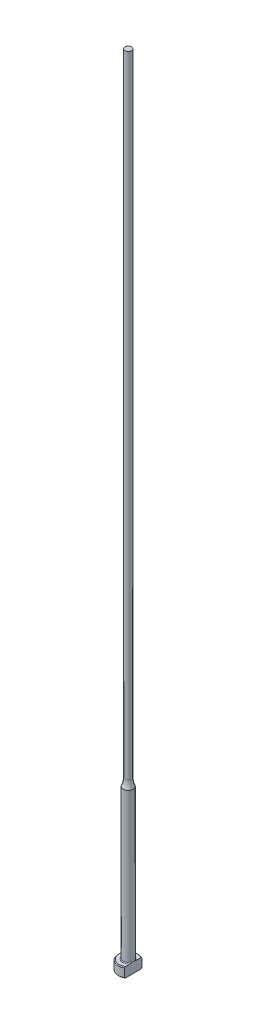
ISO-10303-21;
HEADER;
FILE_DESCRIPTION(('STEP AP214'),'2;1');
FILE_NAME('part.step','',(''),(''),'','','');
FILE_SCHEMA(('AUTOMOTIVE_DESIGN { 1 0 10303 214 1 1 1 1 }'));
ENDSEC;
DATA;
#1=APPLICATION_CONTEXT('core data for automotive mechanical design processes');
#2=APPLICATION_PROTOCOL_DEFINITION('international standard','automotive_design',2000,#1);
#3=PRODUCT_CONTEXT('',#1,'mechanical');
#4=PRODUCT('Part','Part','',(#3));
#5=PRODUCT_RELATED_PRODUCT_CATEGORY('part','',(#4));
#6=PRODUCT_DEFINITION_FORMATION('','',#4);
#7=PRODUCT_DEFINITION_CONTEXT('part definition',#1,'design');
#8=PRODUCT_DEFINITION('design','',#6,#7);
#9=PRODUCT_DEFINITION_SHAPE('','',#8);
#10=(LENGTH_UNIT() NAMED_UNIT(*) SI_UNIT(.MILLI.,.METRE.));
#11=(NAMED_UNIT(*) PLANE_ANGLE_UNIT() SI_UNIT($,.RADIAN.));
#12=(NAMED_UNIT(*) SI_UNIT($,.STERADIAN.) SOLID_ANGLE_UNIT());
#13=UNCERTAINTY_MEASURE_WITH_UNIT(LENGTH_MEASURE(1.E-05),#10,'distance_accuracy_value','');
#14=(GEOMETRIC_REPRESENTATION_CONTEXT(3) GLOBAL_UNCERTAINTY_ASSIGNED_CONTEXT((#13)) GLOBAL_UNIT_ASSIGNED_CONTEXT((#10,
#11,#12)) REPRESENTATION_CONTEXT('',''));
#15=CARTESIAN_POINT('',(0.,0.,0.));
#16=DIRECTION('',(0.,0.,1.));
#17=DIRECTION('',(1.,0.,0.));
#18=AXIS2_PLACEMENT_3D('',#15,#16,#17);
#19=CARTESIAN_POINT('',(-3.17499999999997,3.175,0.));
#20=DIRECTION('',(0.,1.,0.));
#21=DIRECTION('',(0.,0.,1.));
#22=AXIS2_PLACEMENT_3D('',#19,#20,#21);
#23=PLANE('',#22);
#24=CARTESIAN_POINT('',(0.,3.175,0.));
#25=DIRECTION('',(0.,1.,0.));
#26=DIRECTION('',(0.,0.,1.));
#27=AXIS2_PLACEMENT_3D('',#24,#25,#26);
#28=CIRCLE('',#27,2.92099999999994);
#29=CARTESIAN_POINT('',(1.58749999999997,3.175,-2.45195529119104));
#30=VERTEX_POINT('',#29);
#31=CARTESIAN_POINT('',(1.58749999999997,3.175,2.45195529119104));
#32=VERTEX_POINT('',#31);
#33=EDGE_CURVE('E105',#30,#32,#28,.T.);
#34=ORIENTED_EDGE('',*,*,#33,.T.);
#35=DIRECTION('',(0.,0.,1.));
#36=VECTOR('',#35,1.);
#37=CARTESIAN_POINT('',(1.58749999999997,3.17499999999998,2.74963065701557));
#38=LINE('',#37,#36);
#39=CARTESIAN_POINT('',(1.58749999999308,3.175,0.933255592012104));
#40=VERTEX_POINT('',#39);
#41=EDGE_CURVE('E126',#40,#32,#38,.T.);
#42=ORIENTED_EDGE('',*,*,#41,.F.);
#43=CARTESIAN_POINT('',(0.,3.175,0.));
#44=DIRECTION('',(0.,1.,0.));
#45=DIRECTION('',(0.,0.,1.));
#46=AXIS2_PLACEMENT_3D('',#43,#44,#45);
#47=CIRCLE('',#46,1.84149999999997);
#48=CARTESIAN_POINT('',(1.58749999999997,3.17500000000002,-0.933255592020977));
#49=VERTEX_POINT('',#48);
#50=EDGE_CURVE('E11',#40,#49,#47,.F.);
#51=ORIENTED_EDGE('',*,*,#50,.T.);
#52=EDGE_CURVE('E52',#30,#49,#38,.T.);
#53=ORIENTED_EDGE('',*,*,#52,.F.);
#54=EDGE_LOOP('',(#34,#42,#51,#53));
#55=FACE_BOUND('',#54,.T.);
#56=ADVANCED_FACE('F32',(#55),#23,.T.);
#57=CARTESIAN_POINT('',(0.,259.958771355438,0.));
#58=DIRECTION('',(0.,1.,0.));
#59=DIRECTION('',(0.,0.,1.));
#60=AXIS2_PLACEMENT_3D('',#57,#58,#59);
#61=CYLINDRICAL_SURFACE('',#60,3.17499999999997);
#62=CARTESIAN_POINT('',(0.,2.92100000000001,0.));
#63=DIRECTION('',(0.,1.,0.));
#64=DIRECTION('',(0.,0.,1.));
#65=AXIS2_PLACEMENT_3D('',#62,#63,#64);
#66=CIRCLE('',#65,3.17499999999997);
#67=CARTESIAN_POINT('',(1.58749999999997,2.92100000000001,2.74963065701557));
#68=VERTEX_POINT('',#67);
#69=CARTESIAN_POINT('',(1.58749999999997,2.92100000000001,-2.74963065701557));
#70=VERTEX_POINT('',#69);
#71=EDGE_CURVE('E98',#68,#70,#66,.F.);
#72=ORIENTED_EDGE('',*,*,#71,.T.);
#73=DIRECTION('',(0.,-1.,0.));
#74=VECTOR('',#73,1.);
#75=CARTESIAN_POINT('',(1.58749999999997,254.001,-2.74963065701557));
#76=LINE('',#75,#74);
#77=CARTESIAN_POINT('',(1.58749999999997,0.253999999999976,-2.74963065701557));
#78=VERTEX_POINT('',#77);
#79=EDGE_CURVE('E141',#70,#78,#76,.T.);
#80=ORIENTED_EDGE('',*,*,#79,.T.);
#81=CARTESIAN_POINT('',(0.,0.253999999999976,0.));
#82=DIRECTION('',(0.,-1.,0.));
#83=DIRECTION('',(0.,0.,-1.));
#84=AXIS2_PLACEMENT_3D('',#81,#82,#83);
#85=CIRCLE('',#84,3.17499999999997);
#86=CARTESIAN_POINT('',(1.58749999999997,0.253999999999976,2.74963065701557));
#87=VERTEX_POINT('',#86);
#88=EDGE_CURVE('E95',#78,#87,#85,.F.);
#89=ORIENTED_EDGE('',*,*,#88,.T.);
#90=DIRECTION('',(0.,-1.,0.));
#91=VECTOR('',#90,1.);
#92=CARTESIAN_POINT('',(1.58749999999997,254.001,2.74963065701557));
#93=LINE('',#92,#91);
#94=EDGE_CURVE('E88',#68,#87,#93,.T.);
#95=ORIENTED_EDGE('',*,*,#94,.F.);
#96=EDGE_LOOP('',(#72,#80,#89,#95));
#97=FACE_BOUND('',#96,.T.);
#98=ADVANCED_FACE('F191',(#97),#61,.T.);
#99=CARTESIAN_POINT('',(0.,0.,0.));
#100=DIRECTION('',(0.,-1.,0.));
#101=DIRECTION('',(0.,0.,-1.));
#102=AXIS2_PLACEMENT_3D('',#99,#100,#101);
#103=PLANE('',#102);
#104=CARTESIAN_POINT('',(0.,0.,0.));
#105=DIRECTION('',(0.,-1.,0.));
#106=DIRECTION('',(0.,0.,-1.));
#107=AXIS2_PLACEMENT_3D('',#104,#105,#106);
#108=CIRCLE('',#107,2.92100000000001);
#109=CARTESIAN_POINT('',(1.58749999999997,0.,2.45195529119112));
#110=VERTEX_POINT('',#109);
#111=CARTESIAN_POINT('',(1.58749999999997,0.,-2.45195529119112));
#112=VERTEX_POINT('',#111);
#113=EDGE_CURVE('E93',#110,#112,#108,.T.);
#114=ORIENTED_EDGE('',*,*,#113,.T.);
#115=DIRECTION('',(0.,0.,1.));
#116=VECTOR('',#115,1.);
#117=CARTESIAN_POINT('',(1.58749999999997,0.,2.74963065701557));
#118=LINE('',#117,#116);
#119=EDGE_CURVE('E78',#112,#110,#118,.T.);
#120=ORIENTED_EDGE('',*,*,#119,.T.);
#121=EDGE_LOOP('',(#114,#120));
#122=FACE_BOUND('',#121,.T.);
#123=ADVANCED_FACE('F97',(#122),#103,.T.);
#124=CARTESIAN_POINT('',(0.,3.17499999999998,0.));
#125=DIRECTION('',(0.,-1.,0.));
#126=DIRECTION('',(0.,0.,-1.));
#127=AXIS2_PLACEMENT_3D('',#124,#125,#126);
#128=CONICAL_SURFACE('',#127,2.92099999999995,0.785398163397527);
#129=ORIENTED_EDGE('',*,*,#71,.F.);
#130=CARTESIAN_POINT('',(1.58749999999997,-0.16162066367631,-6.0529050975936));
#131=CARTESIAN_POINT('',(1.58749999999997,-0.0288893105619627,-5.91567682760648));
#132=CARTESIAN_POINT('',(1.58749999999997,0.103699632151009,-5.7783103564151));
#133=CARTESIAN_POINT('',(1.58749999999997,0.368508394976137,-5.50321874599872));
#134=CARTESIAN_POINT('',(1.58749999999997,0.500728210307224,-5.36549360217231));
#135=CARTESIAN_POINT('',(1.58749999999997,0.764778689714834,-5.08953516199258));
#136=CARTESIAN_POINT('',(1.58749999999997,0.896609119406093,-4.9513016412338));
#137=CARTESIAN_POINT('',(1.58749999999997,1.15968706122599,-4.67428233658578));
#138=CARTESIAN_POINT('',(1.58749999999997,1.29093457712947,-4.53549655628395));
#139=CARTESIAN_POINT('',(1.58749999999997,1.55007705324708,-4.25997724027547));
#140=CARTESIAN_POINT('',(1.58749999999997,1.67798684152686,-4.12325766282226));
#141=CARTESIAN_POINT('',(1.58749999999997,1.9328486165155,-3.84892898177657));
#142=CARTESIAN_POINT('',(1.58749999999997,2.05980060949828,-3.71131988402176));
#143=CARTESIAN_POINT('',(1.58749999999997,2.31237508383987,-3.43493978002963));
#144=CARTESIAN_POINT('',(1.58749999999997,2.43799784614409,-3.29616903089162));
#145=CARTESIAN_POINT('',(1.58749999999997,2.68741369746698,-3.01699558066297));
#146=CARTESIAN_POINT('',(1.58749999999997,2.81120686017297,-2.8765929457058));
#147=CARTESIAN_POINT('',(1.58749999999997,3.00875865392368,-2.64816703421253));
#148=CARTESIAN_POINT('',(1.58749999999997,3.08336151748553,-2.56087478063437));
#149=CARTESIAN_POINT('',(1.58749999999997,3.2312387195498,-2.38515423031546));
#150=CARTESIAN_POINT('',(1.58749999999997,3.30451292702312,-2.29672582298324));
#151=CARTESIAN_POINT('',(1.58749999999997,3.45004422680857,-2.1174740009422));
#152=CARTESIAN_POINT('',(1.58749999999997,3.5222823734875,-2.02663514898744));
#153=CARTESIAN_POINT('',(1.58749999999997,3.66423097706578,-1.8430252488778));
#154=CARTESIAN_POINT('',(1.58749999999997,3.73394203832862,-1.75025467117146));
#155=CARTESIAN_POINT('',(1.58749999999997,3.87080633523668,-1.5606747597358));
#156=CARTESIAN_POINT('',(1.58749999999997,3.93790459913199,-1.46382547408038));
#157=CARTESIAN_POINT('',(1.58749999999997,4.06669147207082,-1.26632594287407));
#158=CARTESIAN_POINT('',(1.58749999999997,4.1283726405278,-1.16567073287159));
#159=CARTESIAN_POINT('',(1.58749999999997,4.21402252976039,-1.01165766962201));
#160=CARTESIAN_POINT('',(1.58749999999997,4.24127929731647,-0.960142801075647));
#161=CARTESIAN_POINT('',(1.58749999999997,4.2930979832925,-0.855780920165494));
#162=CARTESIAN_POINT('',(1.58749999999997,4.31765941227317,-0.802933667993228));
#163=CARTESIAN_POINT('',(1.58749999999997,4.38614656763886,-0.642461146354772));
#164=CARTESIAN_POINT('',(1.58749999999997,4.42510149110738,-0.532518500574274));
#165=CARTESIAN_POINT('',(1.58749999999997,4.46726244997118,-0.367680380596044));
#166=CARTESIAN_POINT('',(1.58749999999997,4.47844427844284,-0.314802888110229));
#167=CARTESIAN_POINT('',(1.58749999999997,4.49576654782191,-0.208209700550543));
#168=CARTESIAN_POINT('',(1.58749999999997,4.50190743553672,-0.154494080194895));
#169=CARTESIAN_POINT('',(1.58749999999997,4.50871296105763,-0.0468792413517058));
#170=CARTESIAN_POINT('',(1.58749999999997,4.5093945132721,0.00701889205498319));
#171=CARTESIAN_POINT('',(1.58749999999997,4.50527679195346,0.114606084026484));
#172=CARTESIAN_POINT('',(1.58749999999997,4.50047706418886,0.168295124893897));
#173=CARTESIAN_POINT('',(1.58749999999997,4.48579689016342,0.27448544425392));
#174=CARTESIAN_POINT('',(1.58749999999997,4.47596081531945,0.32699298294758));
#175=CARTESIAN_POINT('',(1.58749999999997,4.45181809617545,0.430974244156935));
#176=CARTESIAN_POINT('',(1.58749999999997,4.4375096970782,0.482447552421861));
#177=CARTESIAN_POINT('',(1.58749999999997,4.40502489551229,0.584460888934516));
#178=CARTESIAN_POINT('',(1.58749999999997,4.386827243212,0.634994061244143));
#179=CARTESIAN_POINT('',(1.58749999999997,4.34729308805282,0.734789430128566));
#180=CARTESIAN_POINT('',(1.58749999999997,4.3259572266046,0.784051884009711));
#181=CARTESIAN_POINT('',(1.58749999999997,4.25791922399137,0.930549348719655));
#182=CARTESIAN_POINT('',(1.58749999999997,4.20736047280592,1.0259880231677));
#183=CARTESIAN_POINT('',(1.58749999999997,4.0995545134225,1.21304313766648));
#184=CARTESIAN_POINT('',(1.58749999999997,4.04229912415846,1.30465471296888));
#185=CARTESIAN_POINT('',(1.58749999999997,3.92308746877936,1.48526211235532));
#186=CARTESIAN_POINT('',(1.58749999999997,3.86111349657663,1.57424615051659));
#187=CARTESIAN_POINT('',(1.58749999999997,3.73408621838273,1.74990003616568));
#188=CARTESIAN_POINT('',(1.58749999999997,3.66903444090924,1.83657099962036));
#189=CARTESIAN_POINT('',(1.58749999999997,3.53583371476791,2.00931764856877));
#190=CARTESIAN_POINT('',(1.58749999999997,3.46765527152,2.09537048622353));
#191=CARTESIAN_POINT('',(1.58749999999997,3.32960643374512,2.26611736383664));
#192=CARTESIAN_POINT('',(1.58749999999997,3.25973586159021,2.35081125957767));
#193=CARTESIAN_POINT('',(1.58749999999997,3.04858139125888,2.60290121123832));
#194=CARTESIAN_POINT('',(1.58749999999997,2.90542388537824,2.76872537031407));
#195=CARTESIAN_POINT('',(1.58749999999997,2.64069522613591,3.06970913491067));
#196=CARTESIAN_POINT('',(1.58749999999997,2.51959458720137,3.20528660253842));
#197=CARTESIAN_POINT('',(1.58749999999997,2.27590400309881,3.47510321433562));
#198=CARTESIAN_POINT('',(1.58749999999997,2.15331401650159,3.60934232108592));
#199=CARTESIAN_POINT('',(1.58749999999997,1.90694239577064,3.87695374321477));
#200=CARTESIAN_POINT('',(1.58749999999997,1.78315974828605,4.0103251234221));
#201=CARTESIAN_POINT('',(1.58749999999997,1.53478104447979,4.27630880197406));
#202=CARTESIAN_POINT('',(1.58749999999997,1.41018498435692,4.40892109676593));
#203=CARTESIAN_POINT('',(1.58749999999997,1.0457468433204,4.79499418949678));
#204=CARTESIAN_POINT('',(1.58749999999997,0.80507680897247,5.04767313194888));
#205=CARTESIAN_POINT('',(1.58749999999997,0.443121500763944,5.42550911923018));
#206=CARTESIAN_POINT('',(1.58749999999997,0.322378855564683,5.55118772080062));
#207=CARTESIAN_POINT('',(1.58749999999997,0.0805914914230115,5.80225207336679));
#208=CARTESIAN_POINT('',(1.58749999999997,-0.040453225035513,5.92763782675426));
#209=CARTESIAN_POINT('',(1.58749999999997,-0.161620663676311,6.0529050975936));
#210=B_SPLINE_CURVE_WITH_KNOTS('',3,(#130,#131,#132,#133,#134,#135,#136,#137,#138,#139,#140,
#141,#142,#143,#144,#145,#146,#147,#148,#149,#150,#151,#152,#153,#154,#155,#156,#157,#158,#159,
#160,#161,#162,#163,#164,#165,#166,#167,#168,#169,#170,#171,#172,#173,#174,#175,#176,#177,#178,
#179,#180,#181,#182,#183,#184,#185,#186,#187,#188,#189,#190,#191,#192,#193,#194,#195,#196,#197,
#198,#199,#200,#201,#202,#203,#204,#205,#206,#207,#208,#209),.UNSPECIFIED.,.F.,.F.,(4,2,2,2,2,2,
2,2,2,2,2,2,2,2,2,2,2,2,2,2,2,2,2,2,2,2,2,2,2,2,2,2,2,2,2,2,2,2,2,4),(0.,0.572750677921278,
1.14550874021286,1.71856057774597,2.29160869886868,2.85328006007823,3.4149477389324,
3.97649423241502,4.53801804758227,4.88249307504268,5.22700189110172,5.5751532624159,
5.92322081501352,6.27657800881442,6.63041319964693,6.80518126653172,6.9799810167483,
7.3282426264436,7.49018491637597,7.65211285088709,7.81353889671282,7.97497832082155,
8.13501929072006,8.29512313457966,8.45612518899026,8.61709438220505,8.94062993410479,
9.2645649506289,9.58978187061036,9.91483894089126,10.2441741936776,10.5735441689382,
11.2306812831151,11.7760337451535,12.3214014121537,12.8672825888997,13.4131663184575,
14.4600164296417,14.9828595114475,15.5056983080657),.UNSPECIFIED.);
#211=EDGE_CURVE('E118',#32,#68,#210,.T.);
#212=ORIENTED_EDGE('',*,*,#211,.F.);
#213=ORIENTED_EDGE('',*,*,#33,.F.);
#214=EDGE_CURVE('E117',#70,#30,#210,.T.);
#215=ORIENTED_EDGE('',*,*,#214,.F.);
#216=EDGE_LOOP('',(#129,#212,#213,#215));
#217=FACE_BOUND('',#216,.T.);
#218=ADVANCED_FACE('F162',(#217),#128,.T.);
#219=CARTESIAN_POINT('',(0.,0.253999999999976,0.));
#220=DIRECTION('',(0.,1.,0.));
#221=DIRECTION('',(0.,0.,1.));
#222=AXIS2_PLACEMENT_3D('',#219,#220,#221);
#223=CONICAL_SURFACE('',#222,3.17499999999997,0.785398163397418);
#224=ORIENTED_EDGE('',*,*,#88,.F.);
#225=CARTESIAN_POINT('',(1.58749999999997,3.33662066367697,6.0529050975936));
#226=CARTESIAN_POINT('',(1.58749999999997,3.20388931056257,5.91567682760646));
#227=CARTESIAN_POINT('',(1.58749999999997,3.07130036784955,5.77831035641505));
#228=CARTESIAN_POINT('',(1.58749999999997,2.80649160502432,5.50321874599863));
#229=CARTESIAN_POINT('',(1.58749999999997,2.67427178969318,5.3654936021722));
#230=CARTESIAN_POINT('',(1.58749999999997,2.41022131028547,5.08953516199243));
#231=CARTESIAN_POINT('',(1.58749999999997,2.27839088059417,4.95130164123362));
#232=CARTESIAN_POINT('',(1.58749999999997,2.01531293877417,4.67428233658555));
#233=CARTESIAN_POINT('',(1.58749999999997,1.88406542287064,4.5354965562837));
#234=CARTESIAN_POINT('',(1.58749999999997,1.62492294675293,4.25997724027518));
#235=CARTESIAN_POINT('',(1.58749999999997,1.49701315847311,4.12325766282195));
#236=CARTESIAN_POINT('',(1.58749999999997,1.24215138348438,3.84892898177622));
#237=CARTESIAN_POINT('',(1.58749999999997,1.11519939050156,3.71131988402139));
#238=CARTESIAN_POINT('',(1.58749999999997,0.862624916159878,3.43493978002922));
#239=CARTESIAN_POINT('',(1.58749999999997,0.737002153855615,3.29616903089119));
#240=CARTESIAN_POINT('',(1.58749999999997,0.487586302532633,3.01699558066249));
#241=CARTESIAN_POINT('',(1.58749999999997,0.363793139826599,2.8765929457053));
#242=CARTESIAN_POINT('',(1.58749999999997,0.166241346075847,2.64816703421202));
#243=CARTESIAN_POINT('',(1.58749999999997,0.0916384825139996,2.56087478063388));
#244=CARTESIAN_POINT('',(1.58749999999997,-0.0562387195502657,2.385154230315));
#245=CARTESIAN_POINT('',(1.58749999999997,-0.129512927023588,2.29672582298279));
#246=CARTESIAN_POINT('',(1.58749999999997,-0.27504422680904,2.11747400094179));
#247=CARTESIAN_POINT('',(1.58749999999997,-0.347282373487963,2.02663514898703));
#248=CARTESIAN_POINT('',(1.58749999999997,-0.489230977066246,1.84302524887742));
#249=CARTESIAN_POINT('',(1.58749999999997,-0.558942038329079,1.7502546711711));
#250=CARTESIAN_POINT('',(1.58749999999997,-0.695806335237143,1.56067475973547));
#251=CARTESIAN_POINT('',(1.58749999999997,-0.762904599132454,1.46382547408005));
#252=CARTESIAN_POINT('',(1.58749999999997,-0.891691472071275,1.26632594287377));
#253=CARTESIAN_POINT('',(1.58749999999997,-0.953372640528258,1.16567073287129));
#254=CARTESIAN_POINT('',(1.58749999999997,-1.03902252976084,1.01165766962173));
#255=CARTESIAN_POINT('',(1.58749999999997,-1.06627929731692,0.960142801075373));
#256=CARTESIAN_POINT('',(1.58749999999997,-1.11809798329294,0.85578092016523));
#257=CARTESIAN_POINT('',(1.58749999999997,-1.14265941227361,0.802933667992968));
#258=CARTESIAN_POINT('',(1.58749999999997,-1.21114656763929,0.642461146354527));
#259=CARTESIAN_POINT('',(1.58749999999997,-1.2501014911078,0.532518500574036));
#260=CARTESIAN_POINT('',(1.58749999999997,-1.29226244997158,0.367680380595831));
#261=CARTESIAN_POINT('',(1.58749999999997,-1.30344427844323,0.314802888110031));
#262=CARTESIAN_POINT('',(1.58749999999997,-1.32076654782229,0.208209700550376));
#263=CARTESIAN_POINT('',(1.58749999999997,-1.3269074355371,0.154494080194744));
#264=CARTESIAN_POINT('',(1.58749999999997,-1.333712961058,0.0468792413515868));
#265=CARTESIAN_POINT('',(1.58749999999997,-1.33439451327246,-0.00701889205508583));
#266=CARTESIAN_POINT('',(1.58749999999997,-1.33027679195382,-0.114606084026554));
#267=CARTESIAN_POINT('',(1.58749999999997,-1.32547706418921,-0.168295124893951));
#268=CARTESIAN_POINT('',(1.58749999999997,-1.31079689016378,-0.274485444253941));
#269=CARTESIAN_POINT('',(1.58749999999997,-1.3009608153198,-0.326992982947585));
#270=CARTESIAN_POINT('',(1.58749999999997,-1.27681809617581,-0.430974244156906));
#271=CARTESIAN_POINT('',(1.58749999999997,-1.26250969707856,-0.482447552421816));
#272=CARTESIAN_POINT('',(1.58749999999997,-1.23002489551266,-0.584460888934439));
#273=CARTESIAN_POINT('',(1.58749999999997,-1.21182724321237,-0.634994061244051));
#274=CARTESIAN_POINT('',(1.58749999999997,-1.1722930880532,-0.734789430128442));
#275=CARTESIAN_POINT('',(1.58749999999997,-1.15095722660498,-0.784051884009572));
#276=CARTESIAN_POINT('',(1.58749999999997,-1.08291922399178,-0.93054934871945));
#277=CARTESIAN_POINT('',(1.58749999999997,-1.03236047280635,-1.02598802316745));
#278=CARTESIAN_POINT('',(1.58749999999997,-0.924554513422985,-1.21304313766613));
#279=CARTESIAN_POINT('',(1.58749999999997,-0.86729912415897,-1.30465471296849));
#280=CARTESIAN_POINT('',(1.58749999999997,-0.748087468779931,-1.48526211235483));
#281=CARTESIAN_POINT('',(1.58749999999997,-0.686113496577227,-1.57424615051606));
#282=CARTESIAN_POINT('',(1.58749999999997,-0.55908621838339,-1.74990003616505));
#283=CARTESIAN_POINT('',(1.58749999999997,-0.494034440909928,-1.83657099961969));
#284=CARTESIAN_POINT('',(1.58749999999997,-0.360833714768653,-2.00931764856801));
#285=CARTESIAN_POINT('',(1.58749999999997,-0.292655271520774,-2.09537048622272));
#286=CARTESIAN_POINT('',(1.58749999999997,-0.154606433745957,-2.26611736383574));
#287=CARTESIAN_POINT('',(1.58749999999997,-0.0847358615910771,-2.35081125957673));
#288=CARTESIAN_POINT('',(1.58749999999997,0.126418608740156,-2.60290121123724));
#289=CARTESIAN_POINT('',(1.58749999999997,0.269576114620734,-2.76872537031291));
#290=CARTESIAN_POINT('',(1.58749999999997,0.534304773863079,-3.06970913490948));
#291=CARTESIAN_POINT('',(1.58749999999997,0.655405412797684,-3.20528660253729));
#292=CARTESIAN_POINT('',(1.58749999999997,0.899095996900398,-3.47510321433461));
#293=CARTESIAN_POINT('',(1.58749999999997,1.02168598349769,-3.60934232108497));
#294=CARTESIAN_POINT('',(1.58749999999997,1.26805760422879,-3.87695374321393));
#295=CARTESIAN_POINT('',(1.58749999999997,1.39184025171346,-4.01032512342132));
#296=CARTESIAN_POINT('',(1.58749999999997,1.64021895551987,-4.2763088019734));
#297=CARTESIAN_POINT('',(1.58749999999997,1.76481501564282,-4.40892109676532));
#298=CARTESIAN_POINT('',(1.58749999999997,2.12925315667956,-4.79499418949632));
#299=CARTESIAN_POINT('',(1.58749999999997,2.36992319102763,-5.04767313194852));
#300=CARTESIAN_POINT('',(1.58749999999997,2.73187849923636,-5.42550911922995));
#301=CARTESIAN_POINT('',(1.58749999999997,2.85262114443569,-5.55118772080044));
#302=CARTESIAN_POINT('',(1.58749999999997,3.09440850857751,-5.8022520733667));
#303=CARTESIAN_POINT('',(1.58749999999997,3.2154532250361,-5.92763782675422));
#304=CARTESIAN_POINT('',(1.58749999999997,3.33662066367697,-6.0529050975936));
#305=B_SPLINE_CURVE_WITH_KNOTS('',3,(#225,#226,#227,#228,#229,#230,#231,#232,#233,#234,#235,
#236,#237,#238,#239,#240,#241,#242,#243,#244,#245,#246,#247,#248,#249,#250,#251,#252,#253,#254,
#255,#256,#257,#258,#259,#260,#261,#262,#263,#264,#265,#266,#267,#268,#269,#270,#271,#272,#273,
#274,#275,#276,#277,#278,#279,#280,#281,#282,#283,#284,#285,#286,#287,#288,#289,#290,#291,#292,
#293,#294,#295,#296,#297,#298,#299,#300,#301,#302,#303,#304),.UNSPECIFIED.,.F.,.F.,(4,2,2,2,2,2,
2,2,2,2,2,2,2,2,2,2,2,2,2,2,2,2,2,2,2,2,2,2,2,2,2,2,2,2,2,2,2,2,2,4),(0.,0.57275067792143,
1.14550874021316,1.71856057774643,2.29160869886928,2.85328006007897,3.41494773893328,
3.97649423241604,4.53801804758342,4.88249307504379,5.2270018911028,5.57515326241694,
5.92322081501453,6.27657800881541,6.63041319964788,6.80518126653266,6.97998101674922,
7.32824262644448,7.49018491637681,7.65211285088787,7.81353889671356,7.97497832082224,
8.1350192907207,8.29512313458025,8.45612518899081,8.61709438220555,8.94062993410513,
9.26456495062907,9.58978187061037,9.91483894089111,10.2441741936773,10.5735441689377,
11.2306812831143,11.776033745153,12.3214014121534,12.8672825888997,13.4131663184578,
14.4600164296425,14.9828595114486,15.505698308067),.UNSPECIFIED.);
#306=EDGE_CURVE('E81',#112,#78,#305,.T.);
#307=ORIENTED_EDGE('',*,*,#306,.F.);
#308=ORIENTED_EDGE('',*,*,#113,.F.);
#309=EDGE_CURVE('E84',#87,#110,#305,.T.);
#310=ORIENTED_EDGE('',*,*,#309,.F.);
#311=EDGE_LOOP('',(#224,#307,#308,#310));
#312=FACE_BOUND('',#311,.T.);
#313=ADVANCED_FACE('F92',(#312),#223,.T.);
#314=CARTESIAN_POINT('',(0.,3.42900000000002,0.));
#315=DIRECTION('',(0.,1.,0.));
#316=DIRECTION('',(0.,0.,1.));
#317=AXIS2_PLACEMENT_3D('',#314,#315,#316);
#318=TOROIDAL_SURFACE('',#317,1.84149999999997,0.254);
#319=CARTESIAN_POINT('',(1.58749999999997,3.42900000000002,0.));
#320=CARTESIAN_POINT('',(1.58749999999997,3.42899942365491,-1.9220514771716E-10));
#321=CARTESIAN_POINT('',(1.58749999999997,3.42899884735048,-1.2261161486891E-07));
#322=CARTESIAN_POINT('',(1.58749999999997,3.42899773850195,-5.09676365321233E-07));
#323=CARTESIAN_POINT('',(1.58749999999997,3.42899720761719,-7.78176328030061E-07));
#324=CARTESIAN_POINT('',(1.58749999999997,3.42899614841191,-1.42307272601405E-06));
#325=CARTESIAN_POINT('',(1.58749999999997,3.42899562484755,-1.80713867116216E-06));
#326=CARTESIAN_POINT('',(1.58749999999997,3.42899463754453,-2.63494846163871E-06));
#327=CARTESIAN_POINT('',(1.58749999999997,3.42899417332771,-3.07814756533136E-06));
#328=CARTESIAN_POINT('',(1.58749999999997,3.42899261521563,-4.66897357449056E-06));
#329=CARTESIAN_POINT('',(1.58749999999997,3.42899159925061,-5.89404908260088E-06));
#330=CARTESIAN_POINT('',(1.58749999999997,3.42898979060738,-8.42427511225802E-06));
#331=CARTESIAN_POINT('',(1.58749999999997,3.42898899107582,-9.7248057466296E-06));
#332=CARTESIAN_POINT('',(1.58749999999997,3.42898598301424,-1.48060601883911E-05));
#333=CARTESIAN_POINT('',(1.58749999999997,3.42898393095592,-1.86838281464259E-05));
#334=CARTESIAN_POINT('',(1.58749999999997,3.42898057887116,-2.63261117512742E-05));
#335=CARTESIAN_POINT('',(1.58749999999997,3.42897922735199,-3.00687417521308E-05));
#336=CARTESIAN_POINT('',(1.58749999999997,3.42897347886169,-4.60276298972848E-05));
#337=CARTESIAN_POINT('',(1.58749999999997,3.42896911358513,-5.8247019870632E-05));
#338=CARTESIAN_POINT('',(1.58749999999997,3.42896211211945,-8.11070097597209E-05));
#339=CARTESIAN_POINT('',(1.58749999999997,3.42895931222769,-9.16953114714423E-05));
#340=CARTESIAN_POINT('',(1.58749999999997,3.42893712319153,-0.000168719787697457));
#341=CARTESIAN_POINT('',(1.58749999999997,3.42890881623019,-0.000232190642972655));
#342=CARTESIAN_POINT('',(1.58749999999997,3.42880276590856,-0.000479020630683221));
#343=CARTESIAN_POINT('',(1.58749999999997,3.42873165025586,-0.00066443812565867));
#344=CARTESIAN_POINT('',(1.58749999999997,3.42845137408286,-0.0013844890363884));
#345=CARTESIAN_POINT('',(1.58749999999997,3.42823526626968,-0.00191701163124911));
#346=CARTESIAN_POINT('',(1.58749999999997,3.42735449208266,-0.00409774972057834));
#347=CARTESIAN_POINT('',(1.58749999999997,3.42669768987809,-0.00574830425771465));
#348=CARTESIAN_POINT('',(1.58749999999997,3.4174405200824,-0.0289985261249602));
#349=CARTESIAN_POINT('',(1.58749999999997,3.40878325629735,-0.0505816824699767));
#350=CARTESIAN_POINT('',(1.58749999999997,3.39189297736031,-0.0929947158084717));
#351=CARTESIAN_POINT('',(1.58749999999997,3.38365605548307,-0.11382315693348));
#352=CARTESIAN_POINT('',(1.58749999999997,3.36635393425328,-0.157956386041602));
#353=CARTESIAN_POINT('',(1.58749999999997,3.35730391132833,-0.181267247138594));
#354=CARTESIAN_POINT('',(1.58749999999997,3.33936775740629,-0.228222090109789));
#355=CARTESIAN_POINT('',(1.58749999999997,3.33048420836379,-0.25186705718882));
#356=CARTESIAN_POINT('',(1.58749999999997,3.30894496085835,-0.310512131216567));
#357=CARTESIAN_POINT('',(1.58749999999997,3.29649449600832,-0.345588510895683));
#358=CARTESIAN_POINT('',(1.58749999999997,3.27296975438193,-0.415278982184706));
#359=CARTESIAN_POINT('',(1.58749999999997,3.26186987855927,-0.449884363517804));
#360=CARTESIAN_POINT('',(1.58749999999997,3.2395832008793,-0.524471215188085));
#361=CARTESIAN_POINT('',(1.58749999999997,3.22860862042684,-0.564517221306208));
#362=CARTESIAN_POINT('',(1.58749999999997,3.20902534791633,-0.645529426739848));
#363=CARTESIAN_POINT('',(1.58749999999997,3.20043582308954,-0.686500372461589));
#364=CARTESIAN_POINT('',(1.58749999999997,3.18611712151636,-0.771546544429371));
#365=CARTESIAN_POINT('',(1.58749999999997,3.18059550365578,-0.815658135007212));
#366=CARTESIAN_POINT('',(1.58749999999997,3.17455396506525,-0.904117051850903));
#367=CARTESIAN_POINT('',(1.58749999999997,3.17401361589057,-0.948462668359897));
#368=CARTESIAN_POINT('',(1.58749999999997,3.17898948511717,-1.02531896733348));
#369=CARTESIAN_POINT('',(1.58749999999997,3.1829739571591,-1.05792141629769));
#370=CARTESIAN_POINT('',(1.58749999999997,3.19569167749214,-1.12184393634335));
#371=CARTESIAN_POINT('',(1.58749999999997,3.20436049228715,-1.1531753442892));
#372=CARTESIAN_POINT('',(1.58749999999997,3.22236152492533,-1.19946468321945));
#373=CARTESIAN_POINT('',(1.58749999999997,3.2295150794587,-1.21526783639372));
#374=CARTESIAN_POINT('',(1.58749999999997,3.24587062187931,-1.24583726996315));
#375=CARTESIAN_POINT('',(1.58749999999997,3.25507530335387,-1.26060215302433));
#376=CARTESIAN_POINT('',(1.58749999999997,3.27378481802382,-1.28575815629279));
#377=CARTESIAN_POINT('',(1.58749999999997,3.28289001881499,-1.29644383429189));
#378=CARTESIAN_POINT('',(1.58749999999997,3.30268460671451,-1.31623154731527));
#379=CARTESIAN_POINT('',(1.58749999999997,3.31337067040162,-1.32533681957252));
#380=CARTESIAN_POINT('',(1.58749999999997,3.33349977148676,-1.33941140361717));
#381=CARTESIAN_POINT('',(1.58749999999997,3.34261446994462,-1.34484814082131));
#382=CARTESIAN_POINT('',(1.58749999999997,3.36161455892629,-1.35416329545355));
#383=CARTESIAN_POINT('',(1.58749999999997,3.37149946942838,-1.35804267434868));
#384=CARTESIAN_POINT('',(1.58749999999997,3.39188678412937,-1.36398436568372));
#385=CARTESIAN_POINT('',(1.58749999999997,3.40239309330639,-1.36603350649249));
#386=CARTESIAN_POINT('',(1.58749999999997,3.42360372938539,-1.3680840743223));
#387=CARTESIAN_POINT('',(1.58749999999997,3.43430795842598,-1.36808648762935));
#388=CARTESIAN_POINT('',(1.58749999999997,3.45433283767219,-1.36616208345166));
#389=CARTESIAN_POINT('',(1.58749999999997,3.46367506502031,-1.36444960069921));
#390=CARTESIAN_POINT('',(1.58749999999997,3.48195519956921,-1.35953338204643));
#391=CARTESIAN_POINT('',(1.58749999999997,3.49089304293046,-1.3563294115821));
#392=CARTESIAN_POINT('',(1.58749999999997,3.50850302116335,-1.34848006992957));
#393=CARTESIAN_POINT('',(1.58749999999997,3.5171531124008,-1.34378578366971));
#394=CARTESIAN_POINT('',(1.58749999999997,3.53371257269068,-1.33324445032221));
#395=CARTESIAN_POINT('',(1.58749999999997,3.54162163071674,-1.32739692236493));
#396=CARTESIAN_POINT('',(1.58749999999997,3.56107121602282,-1.31107304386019));
#397=CARTESIAN_POINT('',(1.58749999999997,3.57202221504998,-1.29989286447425));
#398=CARTESIAN_POINT('',(1.58749999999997,3.59202509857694,-1.27593566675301));
#399=CARTESIAN_POINT('',(1.58749999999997,3.60107086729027,-1.26315370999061));
#400=CARTESIAN_POINT('',(1.58749999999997,3.62186023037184,-1.22930733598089));
#401=CARTESIAN_POINT('',(1.58749999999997,3.63240584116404,-1.20751096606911));
#402=CARTESIAN_POINT('',(1.58749999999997,3.65004643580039,-1.16266144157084));
#403=CARTESIAN_POINT('',(1.58749999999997,3.65714435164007,-1.13960937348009));
#404=CARTESIAN_POINT('',(1.58749999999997,3.67265428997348,-1.07603916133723));
#405=CARTESIAN_POINT('',(1.58749999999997,3.67834921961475,-1.03486686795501));
#406=CARTESIAN_POINT('',(1.58749999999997,3.68382880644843,-0.951558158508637));
#407=CARTESIAN_POINT('',(1.58749999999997,3.68350976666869,-0.909417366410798));
#408=CARTESIAN_POINT('',(1.58749999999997,3.67745397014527,-0.811383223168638));
#409=CARTESIAN_POINT('',(1.58749999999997,3.66993873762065,-0.755610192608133));
#410=CARTESIAN_POINT('',(1.58749999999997,3.64933373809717,-0.644937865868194));
#411=CARTESIAN_POINT('',(1.58749999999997,3.63621897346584,-0.59004364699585));
#412=CARTESIAN_POINT('',(1.58749999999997,3.60740922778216,-0.485757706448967));
#413=CARTESIAN_POINT('',(1.58749999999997,3.59201096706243,-0.436281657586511));
#414=CARTESIAN_POINT('',(1.58749999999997,3.55922497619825,-0.338551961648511));
#415=CARTESIAN_POINT('',(1.58749999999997,3.5418584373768,-0.290291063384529));
#416=CARTESIAN_POINT('',(1.58749999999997,3.51760237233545,-0.225557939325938));
#417=CARTESIAN_POINT('',(1.58749999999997,3.51126413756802,-0.208874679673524));
#418=CARTESIAN_POINT('',(1.58749999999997,3.49830042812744,-0.17512392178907));
#419=CARTESIAN_POINT('',(1.58749999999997,3.49167176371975,-0.158057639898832));
#420=CARTESIAN_POINT('',(1.58749999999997,3.47585523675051,-0.117638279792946));
#421=CARTESIAN_POINT('',(1.58749999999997,3.46662970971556,-0.0943002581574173));
#422=CARTESIAN_POINT('',(1.58749999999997,3.44889695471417,-0.0497824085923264));
#423=CARTESIAN_POINT('',(1.58749999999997,3.44040039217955,-0.028598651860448));
#424=CARTESIAN_POINT('',(1.58749999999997,3.43130364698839,-0.00575168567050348));
#425=CARTESIAN_POINT('',(1.58749999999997,3.43064818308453,-0.00410451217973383));
#426=CARTESIAN_POINT('',(1.58749999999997,3.42976776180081,-0.00192459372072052));
#427=CARTESIAN_POINT('',(1.58749999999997,3.42955062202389,-0.00138952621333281));
#428=CARTESIAN_POINT('',(1.58749999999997,3.42926908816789,-0.000666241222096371));
#429=CARTESIAN_POINT('',(1.58749999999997,3.42919771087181,-0.000480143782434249));
#430=CARTESIAN_POINT('',(1.58749999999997,3.42909131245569,-0.000232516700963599));
#431=CARTESIAN_POINT('',(1.58749999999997,3.42906294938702,-0.000168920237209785));
#432=CARTESIAN_POINT('',(1.58749999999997,3.42904072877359,-9.17527162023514E-05));
#433=CARTESIAN_POINT('',(1.58749999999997,3.42903792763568,-8.11550293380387E-05));
#434=CARTESIAN_POINT('',(1.58749999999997,3.42903091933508,-5.82743948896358E-05));
#435=CARTESIAN_POINT('',(1.58749999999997,3.42902654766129,-4.60440001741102E-05));
#436=CARTESIAN_POINT('',(1.58749999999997,3.42902079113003,-3.00727682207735E-05));
#437=CARTESIAN_POINT('',(1.58749999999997,3.42901943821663,-2.63286807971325E-05));
#438=CARTESIAN_POINT('',(1.58749999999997,3.42901608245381,-1.86836529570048E-05));
#439=CARTESIAN_POINT('',(1.58749999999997,3.4290140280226,-1.48046517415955E-05));
#440=CARTESIAN_POINT('',(1.58749999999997,3.42901101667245,-9.72223943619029E-06));
#441=CARTESIAN_POINT('',(1.58749999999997,3.42901021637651,-8.42159649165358E-06));
#442=CARTESIAN_POINT('',(1.58749999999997,3.42900840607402,-5.89129729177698E-06));
#443=CARTESIAN_POINT('',(1.58749999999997,3.42900738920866,-4.66626867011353E-06));
#444=CARTESIAN_POINT('',(1.58749999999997,3.42900582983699,-3.07568803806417E-06));
#445=CARTESIAN_POINT('',(1.58749999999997,3.42900536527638,-2.63259565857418E-06));
#446=CARTESIAN_POINT('',(1.58749999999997,3.4290043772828,-1.80506085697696E-06));
#447=CARTESIAN_POINT('',(1.58749999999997,3.42900385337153,-1.42116387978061E-06));
#448=CARTESIAN_POINT('',(1.58749999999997,3.42900279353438,-7.76675643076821E-07));
#449=CARTESIAN_POINT('',(1.58749999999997,3.42900226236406,-5.08406487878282E-07));
#450=CARTESIAN_POINT('',(1.58749999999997,3.42900115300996,-1.21901887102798E-07));
#451=CARTESIAN_POINT('',(1.58749999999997,3.42900057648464,1.92251677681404E-10));
#452=CARTESIAN_POINT('',(1.58749999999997,3.42900000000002,0.));
#453=B_SPLINE_CURVE_WITH_KNOTS('',3,(#319,#320,#321,#322,#323,#324,#325,#326,#327,#328,#329,
#330,#331,#332,#333,#334,#335,#336,#337,#338,#339,#340,#341,#342,#343,#344,#345,#346,#347,#348,
#349,#350,#351,#352,#353,#354,#355,#356,#357,#358,#359,#360,#361,#362,#363,#364,#365,#366,#367,
#368,#369,#370,#371,#372,#373,#374,#375,#376,#377,#378,#379,#380,#381,#382,#383,#384,#385,#386,
#387,#388,#389,#390,#391,#392,#393,#394,#395,#396,#397,#398,#399,#400,#401,#402,#403,#404,#405,
#406,#407,#408,#409,#410,#411,#412,#413,#414,#415,#416,#417,#418,#419,#420,#421,#422,#423,#424,
#425,#426,#427,#428,#429,#430,#431,#432,#433,#434,#435,#436,#437,#438,#439,#440,#441,#442,#443,
#444,#445,#446,#447,#448,#449,#450,#451,#452),.UNSPECIFIED.,.T.,.F.,(4,2,2,2,2,2,2,2,2,2,2,2,2,
2,2,2,2,2,2,2,2,2,2,2,2,2,2,2,2,2,2,2,2,2,2,2,2,2,2,2,2,2,2,2,2,2,2,2,2,2,2,2,2,2,2,2,2,2,2,2,2,
2,2,2,2,2,4),(0.,1.72815458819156E-06,3.50429255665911E-06,5.44431004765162E-06,
7.3675525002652E-06,1.2119089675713E-05,1.66953775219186E-05,2.98160400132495E-05,
4.17409564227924E-05,8.0660475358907E-05,0.000113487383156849,0.000321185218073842,
0.000917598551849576,0.00264089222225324,0.00797105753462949,0.0777276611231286,
0.144923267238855,0.219939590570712,0.295714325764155,0.407362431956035,0.516367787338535,
0.640878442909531,0.766362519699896,0.899536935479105,1.03216495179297,1.13045740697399,
1.22743103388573,1.27935899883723,1.33135556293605,1.37333248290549,1.41522237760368,
1.44693946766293,1.47863694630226,1.51056074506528,1.54246916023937,1.57083210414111,
1.59919951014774,1.62861579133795,1.65804436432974,1.70472658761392,1.75155645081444,
1.82378709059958,1.89595619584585,2.01995471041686,2.1460932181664,2.31447224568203,
2.48361094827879,2.6389891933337,2.79283011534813,2.84637031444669,2.9012946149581,
2.97658236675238,3.04504771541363,3.05036697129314,3.05209849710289,3.05269709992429,
3.05290520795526,3.05293806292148,3.05297701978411,3.05298895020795,3.05300207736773,
3.05300665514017,3.0530114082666,3.05301333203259,3.05301527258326,3.05301704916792,
3.05301877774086),.UNSPECIFIED.);
#454=CARTESIAN_POINT('',(1.58749999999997,3.42900000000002,0.));
#455=VERTEX_POINT('',#454);
#456=EDGE_CURVE('E47',#455,#49,#453,.T.);
#457=ORIENTED_EDGE('',*,*,#456,.T.);
#458=ORIENTED_EDGE('',*,*,#50,.F.);
#459=CARTESIAN_POINT('',(1.58749999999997,3.42900000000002,0.));
#460=CARTESIAN_POINT('',(1.58749999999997,3.42900057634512,1.9220512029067E-10));
#461=CARTESIAN_POINT('',(1.58749999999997,3.42900115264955,1.22611614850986E-07));
#462=CARTESIAN_POINT('',(1.58749999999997,3.42900226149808,5.09676365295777E-07));
#463=CARTESIAN_POINT('',(1.58749999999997,3.42900279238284,7.78176328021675E-07));
#464=CARTESIAN_POINT('',(1.58749999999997,3.42900385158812,1.42307272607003E-06));
#465=CARTESIAN_POINT('',(1.58749999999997,3.42900437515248,1.80713867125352E-06));
#466=CARTESIAN_POINT('',(1.58749999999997,3.4290053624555,2.63494846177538E-06));
#467=CARTESIAN_POINT('',(1.58749999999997,3.42900582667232,3.0781475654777E-06));
#468=CARTESIAN_POINT('',(1.58749999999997,3.4290073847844,4.66897357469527E-06));
#469=CARTESIAN_POINT('',(1.58749999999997,3.42900840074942,5.89404908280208E-06));
#470=CARTESIAN_POINT('',(1.58749999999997,3.42901020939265,8.42427511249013E-06));
#471=CARTESIAN_POINT('',(1.58749999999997,3.42901100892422,9.72480574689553E-06));
#472=CARTESIAN_POINT('',(1.58749999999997,3.42901401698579,1.48060601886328E-05));
#473=CARTESIAN_POINT('',(1.58749999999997,3.42901606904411,1.86838281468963E-05));
#474=CARTESIAN_POINT('',(1.58749999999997,3.42901942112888,2.63261117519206E-05));
#475=CARTESIAN_POINT('',(1.58749999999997,3.42902077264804,3.00687417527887E-05));
#476=CARTESIAN_POINT('',(1.58749999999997,3.42902652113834,4.60276298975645E-05));
#477=CARTESIAN_POINT('',(1.58749999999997,3.4290308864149,5.82470198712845E-05));
#478=CARTESIAN_POINT('',(1.58749999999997,3.42903788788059,8.11070097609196E-05));
#479=CARTESIAN_POINT('',(1.58749999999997,3.42904068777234,9.16953114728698E-05));
#480=CARTESIAN_POINT('',(1.58749999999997,3.4290628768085,0.000168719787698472));
#481=CARTESIAN_POINT('',(1.58749999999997,3.42909118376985,0.000232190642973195));
#482=CARTESIAN_POINT('',(1.58749999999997,3.42919723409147,0.000479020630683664));
#483=CARTESIAN_POINT('',(1.58749999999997,3.42926834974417,0.000664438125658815));
#484=CARTESIAN_POINT('',(1.58749999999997,3.42954862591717,0.00138448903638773));
#485=CARTESIAN_POINT('',(1.58749999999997,3.42976473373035,0.00191701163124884));
#486=CARTESIAN_POINT('',(1.58749999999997,3.43064550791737,0.00409774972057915));
#487=CARTESIAN_POINT('',(1.58749999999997,3.43130231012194,0.00574830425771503));
#488=CARTESIAN_POINT('',(1.58749999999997,3.44055947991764,0.0289985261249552));
#489=CARTESIAN_POINT('',(1.58749999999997,3.44921674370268,0.0505816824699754));
#490=CARTESIAN_POINT('',(1.58749999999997,3.46610702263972,0.0929947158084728));
#491=CARTESIAN_POINT('',(1.58749999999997,3.47434394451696,0.11382315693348));
#492=CARTESIAN_POINT('',(1.58749999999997,3.49164606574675,0.157956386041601));
#493=CARTESIAN_POINT('',(1.58749999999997,3.5006960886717,0.181267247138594));
#494=CARTESIAN_POINT('',(1.58749999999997,3.51863224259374,0.228222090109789));
#495=CARTESIAN_POINT('',(1.58749999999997,3.52751579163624,0.25186705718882));
#496=CARTESIAN_POINT('',(1.58749999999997,3.54905503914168,0.310512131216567));
#497=CARTESIAN_POINT('',(1.58749999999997,3.56150550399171,0.345588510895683));
#498=CARTESIAN_POINT('',(1.58749999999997,3.5850302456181,0.415278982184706));
#499=CARTESIAN_POINT('',(1.58749999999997,3.59613012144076,0.449884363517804));
#500=CARTESIAN_POINT('',(1.58749999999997,3.61841679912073,0.524471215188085));
#501=CARTESIAN_POINT('',(1.58749999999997,3.62939137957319,0.564517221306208));
#502=CARTESIAN_POINT('',(1.58749999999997,3.6489746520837,0.645529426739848));
#503=CARTESIAN_POINT('',(1.58749999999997,3.65756417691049,0.686500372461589));
#504=CARTESIAN_POINT('',(1.58749999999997,3.67188287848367,0.771546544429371));
#505=CARTESIAN_POINT('',(1.58749999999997,3.67740449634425,0.815658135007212));
#506=CARTESIAN_POINT('',(1.58749999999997,3.68344603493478,0.904117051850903));
#507=CARTESIAN_POINT('',(1.58749999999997,3.68398638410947,0.948462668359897));
#508=CARTESIAN_POINT('',(1.58749999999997,3.67901051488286,1.02531896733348));
#509=CARTESIAN_POINT('',(1.58749999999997,3.67502604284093,1.05792141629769));
#510=CARTESIAN_POINT('',(1.58749999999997,3.66230832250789,1.12184393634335));
#511=CARTESIAN_POINT('',(1.58749999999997,3.65363950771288,1.1531753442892));
#512=CARTESIAN_POINT('',(1.58749999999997,3.6356384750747,1.19946468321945));
#513=CARTESIAN_POINT('',(1.58749999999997,3.62848492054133,1.21526783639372));
#514=CARTESIAN_POINT('',(1.58749999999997,3.61212937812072,1.24583726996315));
#515=CARTESIAN_POINT('',(1.58749999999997,3.60292469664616,1.26060215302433));
#516=CARTESIAN_POINT('',(1.58749999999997,3.58421518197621,1.28575815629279));
#517=CARTESIAN_POINT('',(1.58749999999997,3.57510998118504,1.29644383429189));
#518=CARTESIAN_POINT('',(1.58749999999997,3.55531539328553,1.31623154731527));
#519=CARTESIAN_POINT('',(1.58749999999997,3.54462932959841,1.32533681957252));
#520=CARTESIAN_POINT('',(1.58749999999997,3.52450022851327,1.33941140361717));
#521=CARTESIAN_POINT('',(1.58749999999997,3.51538553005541,1.34484814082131));
#522=CARTESIAN_POINT('',(1.58749999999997,3.49638544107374,1.35416329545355));
#523=CARTESIAN_POINT('',(1.58749999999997,3.48650053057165,1.35804267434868));
#524=CARTESIAN_POINT('',(1.58749999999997,3.46611321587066,1.36398436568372));
#525=CARTESIAN_POINT('',(1.58749999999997,3.45560690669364,1.36603350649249));
#526=CARTESIAN_POINT('',(1.58749999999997,3.43439627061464,1.3680840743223));
#527=CARTESIAN_POINT('',(1.58749999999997,3.42369204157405,1.36808648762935));
#528=CARTESIAN_POINT('',(1.58749999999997,3.40366716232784,1.36616208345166));
#529=CARTESIAN_POINT('',(1.58749999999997,3.39432493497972,1.36444960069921));
#530=CARTESIAN_POINT('',(1.58749999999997,3.37604480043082,1.35953338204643));
#531=CARTESIAN_POINT('',(1.58749999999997,3.36710695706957,1.3563294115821));
#532=CARTESIAN_POINT('',(1.58749999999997,3.34949697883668,1.34848006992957));
#533=CARTESIAN_POINT('',(1.58749999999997,3.34084688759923,1.34378578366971));
#534=CARTESIAN_POINT('',(1.58749999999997,3.32428742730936,1.33324445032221));
#535=CARTESIAN_POINT('',(1.58749999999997,3.31637836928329,1.32739692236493));
#536=CARTESIAN_POINT('',(1.58749999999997,3.29692878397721,1.31107304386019));
#537=CARTESIAN_POINT('',(1.58749999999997,3.28597778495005,1.29989286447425));
#538=CARTESIAN_POINT('',(1.58749999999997,3.26597490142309,1.27593566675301));
#539=CARTESIAN_POINT('',(1.58749999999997,3.25692913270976,1.26315370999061));
#540=CARTESIAN_POINT('',(1.58749999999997,3.23613976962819,1.22930733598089));
#541=CARTESIAN_POINT('',(1.58749999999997,3.22559415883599,1.20751096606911));
#542=CARTESIAN_POINT('',(1.58749999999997,3.20795356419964,1.16266144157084));
#543=CARTESIAN_POINT('',(1.58749999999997,3.20085564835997,1.13960937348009));
#544=CARTESIAN_POINT('',(1.58749999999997,3.18534571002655,1.07603916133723));
#545=CARTESIAN_POINT('',(1.58749999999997,3.17965078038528,1.03486686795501));
#546=CARTESIAN_POINT('',(1.58749999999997,3.1741711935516,0.951558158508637));
#547=CARTESIAN_POINT('',(1.58749999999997,3.17449023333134,0.909417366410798));
#548=CARTESIAN_POINT('',(1.58749999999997,3.18054602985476,0.811383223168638));
#549=CARTESIAN_POINT('',(1.58749999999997,3.18806126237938,0.755610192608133));
#550=CARTESIAN_POINT('',(1.58749999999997,3.20866626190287,0.644937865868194));
#551=CARTESIAN_POINT('',(1.58749999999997,3.2217810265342,0.59004364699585));
#552=CARTESIAN_POINT('',(1.58749999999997,3.25059077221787,0.485757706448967));
#553=CARTESIAN_POINT('',(1.58749999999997,3.2659890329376,0.43628165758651));
#554=CARTESIAN_POINT('',(1.58749999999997,3.29877502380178,0.338551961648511));
#555=CARTESIAN_POINT('',(1.58749999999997,3.31614156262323,0.290291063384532));
#556=CARTESIAN_POINT('',(1.58749999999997,3.34039762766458,0.225557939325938));
#557=CARTESIAN_POINT('',(1.58749999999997,3.346735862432,0.208874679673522));
#558=CARTESIAN_POINT('',(1.58749999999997,3.35969957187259,0.175123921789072));
#559=CARTESIAN_POINT('',(1.58749999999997,3.3663282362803,0.15805763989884));
#560=CARTESIAN_POINT('',(1.58749999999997,3.3821447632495,0.117638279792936));
#561=CARTESIAN_POINT('',(1.58749999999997,3.39137029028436,0.0943002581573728));
#562=CARTESIAN_POINT('',(1.58749999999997,3.40910304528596,0.0497824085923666));
#563=CARTESIAN_POINT('',(1.58749999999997,3.41759960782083,0.0285986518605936));
#564=CARTESIAN_POINT('',(1.58749999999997,3.42669635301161,0.00575168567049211));
#565=CARTESIAN_POINT('',(1.58749999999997,3.42735181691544,0.00410451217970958));
#566=CARTESIAN_POINT('',(1.58749999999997,3.42823223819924,0.00192459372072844));
#567=CARTESIAN_POINT('',(1.58749999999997,3.42844937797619,0.00138952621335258));
#568=CARTESIAN_POINT('',(1.58749999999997,3.42873091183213,0.000666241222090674));
#569=CARTESIAN_POINT('',(1.58749999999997,3.42880228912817,0.000480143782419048));
#570=CARTESIAN_POINT('',(1.58749999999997,3.42890868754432,0.000232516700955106));
#571=CARTESIAN_POINT('',(1.58749999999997,3.42893705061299,0.000168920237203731));
#572=CARTESIAN_POINT('',(1.58749999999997,3.42895927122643,9.17527161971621E-05));
#573=CARTESIAN_POINT('',(1.58749999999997,3.42896207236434,8.1155029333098E-05));
#574=CARTESIAN_POINT('',(1.58749999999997,3.42896908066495,5.82743948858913E-05));
#575=CARTESIAN_POINT('',(1.58749999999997,3.42897345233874,4.60440001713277E-05));
#576=CARTESIAN_POINT('',(1.58749999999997,3.42897920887,3.00727682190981E-05));
#577=CARTESIAN_POINT('',(1.58749999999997,3.42898056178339,2.63286807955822E-05));
#578=CARTESIAN_POINT('',(1.58749999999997,3.42898391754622,1.86836529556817E-05));
#579=CARTESIAN_POINT('',(1.58749999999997,3.42898597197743,1.48046517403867E-05));
#580=CARTESIAN_POINT('',(1.58749999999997,3.42898898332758,9.72223943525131E-06));
#581=CARTESIAN_POINT('',(1.58749999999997,3.42898978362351,8.42159649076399E-06));
#582=CARTESIAN_POINT('',(1.58749999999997,3.42899159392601,5.89129729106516E-06));
#583=CARTESIAN_POINT('',(1.58749999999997,3.42899261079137,4.66626866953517E-06));
#584=CARTESIAN_POINT('',(1.58749999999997,3.42899417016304,3.0756880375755E-06));
#585=CARTESIAN_POINT('',(1.58749999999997,3.42899463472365,2.63259565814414E-06));
#586=CARTESIAN_POINT('',(1.58749999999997,3.42899562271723,1.80506085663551E-06));
#587=CARTESIAN_POINT('',(1.58749999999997,3.42899614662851,1.42116387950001E-06));
#588=CARTESIAN_POINT('',(1.58749999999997,3.42899720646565,7.7667564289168E-07));
#589=CARTESIAN_POINT('',(1.58749999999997,3.42899773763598,5.0840648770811E-07));
#590=CARTESIAN_POINT('',(1.58749999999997,3.42899884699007,1.21901887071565E-07));
#591=CARTESIAN_POINT('',(1.58749999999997,3.42899942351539,-1.92251650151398E-10));
#592=CARTESIAN_POINT('',(1.58749999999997,3.42900000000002,0.));
#593=B_SPLINE_CURVE_WITH_KNOTS('',3,(#459,#460,#461,#462,#463,#464,#465,#466,#467,#468,#469,
#470,#471,#472,#473,#474,#475,#476,#477,#478,#479,#480,#481,#482,#483,#484,#485,#486,#487,#488,
#489,#490,#491,#492,#493,#494,#495,#496,#497,#498,#499,#500,#501,#502,#503,#504,#505,#506,#507,
#508,#509,#510,#511,#512,#513,#514,#515,#516,#517,#518,#519,#520,#521,#522,#523,#524,#525,#526,
#527,#528,#529,#530,#531,#532,#533,#534,#535,#536,#537,#538,#539,#540,#541,#542,#543,#544,#545,
#546,#547,#548,#549,#550,#551,#552,#553,#554,#555,#556,#557,#558,#559,#560,#561,#562,#563,#564,
#565,#566,#567,#568,#569,#570,#571,#572,#573,#574,#575,#576,#577,#578,#579,#580,#581,#582,#583,
#584,#585,#586,#587,#588,#589,#590,#591,#592),.UNSPECIFIED.,.T.,.F.,(4,2,2,2,2,2,2,2,2,2,2,2,2,
2,2,2,2,2,2,2,2,2,2,2,2,2,2,2,2,2,2,2,2,2,2,2,2,2,2,2,2,2,2,2,2,2,2,2,2,2,2,2,2,2,2,2,2,2,2,2,2,
2,2,2,2,2,4),(0.,1.72815458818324E-06,3.50429255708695E-06,5.44431004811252E-06,
7.36755250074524E-06,1.21190896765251E-05,1.66953775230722E-05,2.98160400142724E-05,
4.17409564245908E-05,8.06604753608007E-05,0.000113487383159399,0.000321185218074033,
0.000917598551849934,0.00264089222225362,0.00797105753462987,0.077727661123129,
0.144923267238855,0.219939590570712,0.295714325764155,0.407362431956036,0.516367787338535,
0.640878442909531,0.766362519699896,0.899536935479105,1.03216495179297,1.13045740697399,
1.22743103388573,1.27935899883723,1.33135556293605,1.37333248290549,1.41522237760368,
1.44693946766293,1.47863694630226,1.51056074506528,1.54246916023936,1.57083210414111,
1.59919951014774,1.62861579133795,1.65804436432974,1.70472658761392,1.75155645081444,
1.82378709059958,1.89595619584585,2.01995471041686,2.1460932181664,2.31447224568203,
2.48361094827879,2.6389891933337,2.79283011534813,2.84637031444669,2.9012946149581,
2.97658236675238,3.04504771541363,3.05036697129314,3.05209849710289,3.05269709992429,
3.05290520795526,3.05293806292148,3.05297701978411,3.05298895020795,3.05300207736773,
3.05300665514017,3.0530114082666,3.05301333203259,3.05301527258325,3.05301704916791,
3.05301877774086),.UNSPECIFIED.);
#594=EDGE_CURVE('E147',#40,#455,#593,.T.);
#595=ORIENTED_EDGE('',*,*,#594,.T.);
#596=CARTESIAN_POINT('',(0.,3.42900000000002,0.));
#597=DIRECTION('',(0.,1.,0.));
#598=DIRECTION('',(0.,0.,1.));
#599=AXIS2_PLACEMENT_3D('',#596,#597,#598);
#600=CIRCLE('',#599,1.58749999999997);
#601=EDGE_CURVE('E40',#455,#455,#600,.T.);
#602=ORIENTED_EDGE('',*,*,#601,.F.);
#603=EDGE_LOOP('',(#457,#458,#595,#602));
#604=FACE_BOUND('',#603,.T.);
#605=ADVANCED_FACE('F34',(#604),#318,.F.);
#606=CARTESIAN_POINT('',(-1.05536999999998,254.,0.));
#607=DIRECTION('',(0.,1.,0.));
#608=DIRECTION('',(0.,0.,1.));
#609=AXIS2_PLACEMENT_3D('',#606,#607,#608);
#610=PLANE('',#609);
#611=CARTESIAN_POINT('',(0.,254.,0.));
#612=DIRECTION('',(0.,1.,0.));
#613=DIRECTION('',(0.,0.,1.));
#614=AXIS2_PLACEMENT_3D('',#611,#612,#613);
#615=CIRCLE('',#614,1.05536999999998);
#616=CARTESIAN_POINT('',(0.,254.,1.05536999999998));
#617=VERTEX_POINT('',#616);
#618=EDGE_CURVE('E108',#617,#617,#615,.T.);
#619=ORIENTED_EDGE('',*,*,#618,.T.);
#620=EDGE_LOOP('',(#619));
#621=FACE_BOUND('',#620,.T.);
#622=ADVANCED_FACE('F180',(#621),#610,.T.);
#623=CARTESIAN_POINT('',(0.,259.958771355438,0.));
#624=DIRECTION('',(0.,1.,0.));
#625=DIRECTION('',(0.,0.,1.));
#626=AXIS2_PLACEMENT_3D('',#623,#624,#625);
#627=CYLINDRICAL_SURFACE('',#626,1.05536999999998);
#628=CARTESIAN_POINT('',(0.,53.3445802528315,0.));
#629=DIRECTION('',(0.,1.,0.));
#630=DIRECTION('',(0.,0.,1.));
#631=AXIS2_PLACEMENT_3D('',#628,#629,#630);
#632=CIRCLE('',#631,1.05536999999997);
#633=CARTESIAN_POINT('',(0.,53.3445802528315,1.05536999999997));
#634=VERTEX_POINT('',#633);
#635=EDGE_CURVE('E111',#634,#634,#632,.T.);
#636=ORIENTED_EDGE('',*,*,#635,.T.);
#637=EDGE_LOOP('',(#636));
#638=FACE_BOUND('',#637,.T.);
#639=ORIENTED_EDGE('',*,*,#618,.F.);
#640=EDGE_LOOP('',(#639));
#641=FACE_BOUND('',#640,.T.);
#642=ADVANCED_FACE('F174',(#638,#641),#627,.T.);
#643=CARTESIAN_POINT('',(0.,53.3445802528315,0.));
#644=DIRECTION('',(0.,1.,0.));
#645=DIRECTION('',(0.,0.,1.));
#646=AXIS2_PLACEMENT_3D('',#643,#644,#645);
#647=TOROIDAL_SURFACE('',#646,7.40536999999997,6.35);
#648=CARTESIAN_POINT('',(0.,50.8,0.));
#649=DIRECTION('',(0.,1.,0.));
#650=DIRECTION('',(0.,0.,1.));
#651=AXIS2_PLACEMENT_3D('',#648,#649,#650);
#652=CIRCLE('',#651,1.58749999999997);
#653=CARTESIAN_POINT('',(0.,50.8,1.58749999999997));
#654=VERTEX_POINT('',#653);
#655=EDGE_CURVE('E114',#654,#654,#652,.T.);
#656=ORIENTED_EDGE('',*,*,#655,.T.);
#657=EDGE_LOOP('',(#656));
#658=FACE_BOUND('',#657,.T.);
#659=ORIENTED_EDGE('',*,*,#635,.F.);
#660=EDGE_LOOP('',(#659));
#661=FACE_BOUND('',#660,.T.);
#662=ADVANCED_FACE('F168',(#658,#661),#647,.F.);
#663=CARTESIAN_POINT('',(0.,259.958771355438,0.));
#664=DIRECTION('',(0.,1.,0.));
#665=DIRECTION('',(0.,0.,1.));
#666=AXIS2_PLACEMENT_3D('',#663,#664,#665);
#667=CYLINDRICAL_SURFACE('',#666,1.58749999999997);
#668=ORIENTED_EDGE('',*,*,#601,.T.);
#669=EDGE_LOOP('',(#668));
#670=FACE_BOUND('',#669,.T.);
#671=ORIENTED_EDGE('',*,*,#655,.F.);
#672=EDGE_LOOP('',(#671));
#673=FACE_BOUND('',#672,.T.);
#674=ADVANCED_FACE('F165',(#670,#673),#667,.T.);
#675=CARTESIAN_POINT('',(1.58749999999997,254.001,2.74963065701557));
#676=DIRECTION('',(1.,0.,0.));
#677=DIRECTION('',(0.,0.,-1.));
#678=AXIS2_PLACEMENT_3D('',#675,#676,#677);
#679=PLANE('',#678);
#680=ORIENTED_EDGE('',*,*,#309,.T.);
#681=ORIENTED_EDGE('',*,*,#119,.F.);
#682=ORIENTED_EDGE('',*,*,#306,.T.);
#683=ORIENTED_EDGE('',*,*,#79,.F.);
#684=ORIENTED_EDGE('',*,*,#214,.T.);
#685=ORIENTED_EDGE('',*,*,#52,.T.);
#686=ORIENTED_EDGE('',*,*,#456,.F.);
#687=ORIENTED_EDGE('',*,*,#594,.F.);
#688=ORIENTED_EDGE('',*,*,#41,.T.);
#689=ORIENTED_EDGE('',*,*,#211,.T.);
#690=ORIENTED_EDGE('',*,*,#94,.T.);
#691=EDGE_LOOP('',(#680,#681,#682,#683,#684,#685,#686,#687,#688,#689,#690));
#692=FACE_BOUND('',#691,.T.);
#693=ADVANCED_FACE('F80',(#692),#679,.T.);
#694=CLOSED_SHELL('',(#56,#98,#123,#218,#313,#605,#622,#642,#662,#674,#693));
#695=MANIFOLD_SOLID_BREP('B2',#694);
#696=ADVANCED_BREP_SHAPE_REPRESENTATION('',(#18,#695),#14);
#697=SHAPE_DEFINITION_REPRESENTATION(#9,#696);
ENDSEC;
END-ISO-10303-21;
